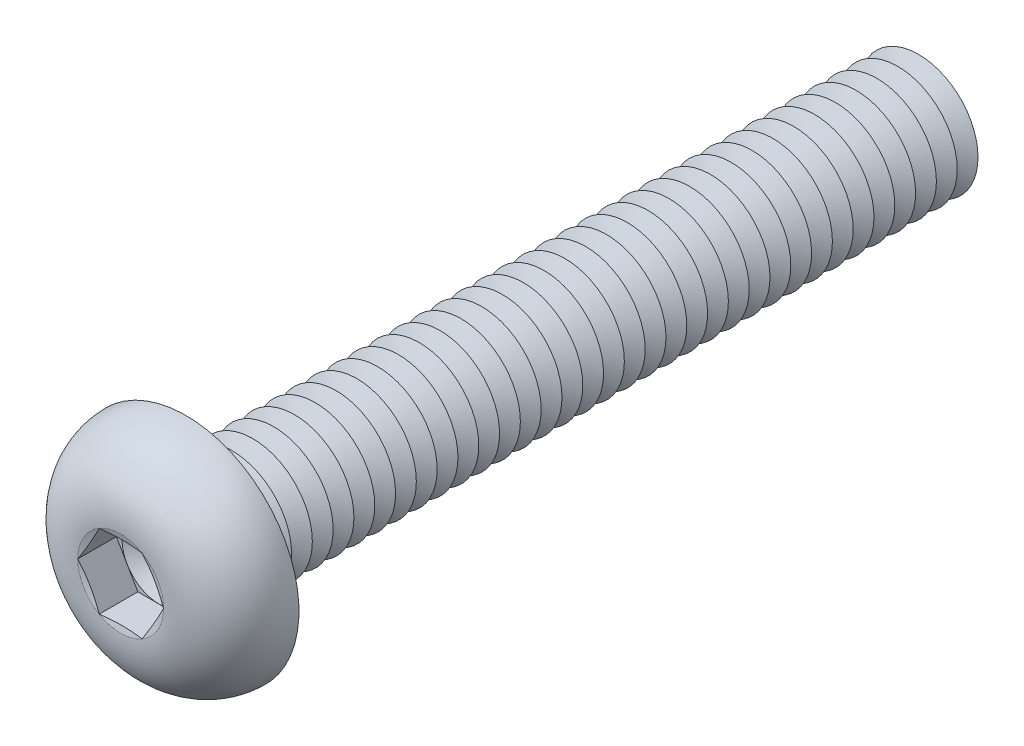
from build123d import *

# Parameters (mm, degrees)
FILLET1_R          = 0.35
LPATTERN1_COUNT    = 35
LPATTERN1_PITCH    = 0.7
CUT_EXTRUDE1_DEPTH = 1.3


with BuildPart() as part:
    # Sketch1 → Revolve1 (revolve)
    with BuildSketch(Plane(origin=(0, 0, 0), x_dir=(0, 0, -1), z_dir=(1, 0, 0)), mode=Mode.PRIVATE) as revolve1_sk:
        with BuildLine():
            Line((0, 2), (0, 3.8))
            ThreePointArc((0, 3.8), (-1.611961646, 3.099623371), (-2.2, 1.443375))
            Line((-2.2, 1.443375), (-2.006624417, 0.7216875))
            Line((-2.006624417, 0.7216875), (-2.2, 0.7216875))
            Line((-2.2, 0.7216875), (-2.2, 0))
            Line((-2.2, 0), (25, 0))
            Line((25, 0), (25, 2))
            Line((25, 2), (0, 2))
        make_face()
    revolve(revolve1_sk.sketch.rotate(Axis((0, 0, -25), (0, 0, 1)), 90), axis=Axis((0, 0, -25), (0, 0, 1)))

    # Fillet1
    fillet1_edges = [part.edges().sort_by_distance(p)[0] for p in [
        (2, 0, 0),
    ]]
    fillet(fillet1_edges, radius=FILLET1_R)

    # Sketch2 → Cut-Revolve1 (revolve, cut)
    with BuildSketch(Plane(origin=(0, 0, 0), x_dir=(0, 0, -1), z_dir=(1, 0, 0)), mode=Mode.PRIVATE) as cut_revolve1_sk:
        Polygon((24.65, 2), (25.35, 2), (25, 1.393782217), align=None)
    cut_revolve1 = revolve(cut_revolve1_sk.sketch.rotate(Axis((0, 0, -25), (0, 0, -1)), 270), axis=Axis((0, 0, -25), (0, 0, -1)), mode=Mode.SUBTRACT)

    # LPattern1: Cut-Revolve1 ×35
    with Locations(*[(0, 0, i * LPATTERN1_PITCH) for i in range(1, LPATTERN1_COUNT)]):
        add(cut_revolve1, mode=Mode.SUBTRACT)

    # Sketch3 → Cut-Extrude1 (cut)
    with BuildSketch(Plane.XY.offset(2.2)):
        Polygon((0.7216875, 1.249999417), (-0.7216875, 1.249999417), (-1.443375, 0), (-0.7216875, -1.249999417), (0.7216875, -1.249999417), (1.443375, 0), align=None)
    extrude(amount=-CUT_EXTRUDE1_DEPTH, mode=Mode.SUBTRACT)

    # Cut-Extrude2 cone 1 section (on through the dimple's axis) → Cut-Extrude2 (revolve, cut)
    with BuildSketch(Plane(origin=(0, 0, 0.9), x_dir=(0, -1, 0), z_dir=(1, 0, 0))):
        Polygon((0, 0), (1.249999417, 0), (0, 0.7216875), align=None)
    revolve(axis=Axis((0, 0, 0.9), (0, 0, -1)), mode=Mode.SUBTRACT)


solid = part.part
